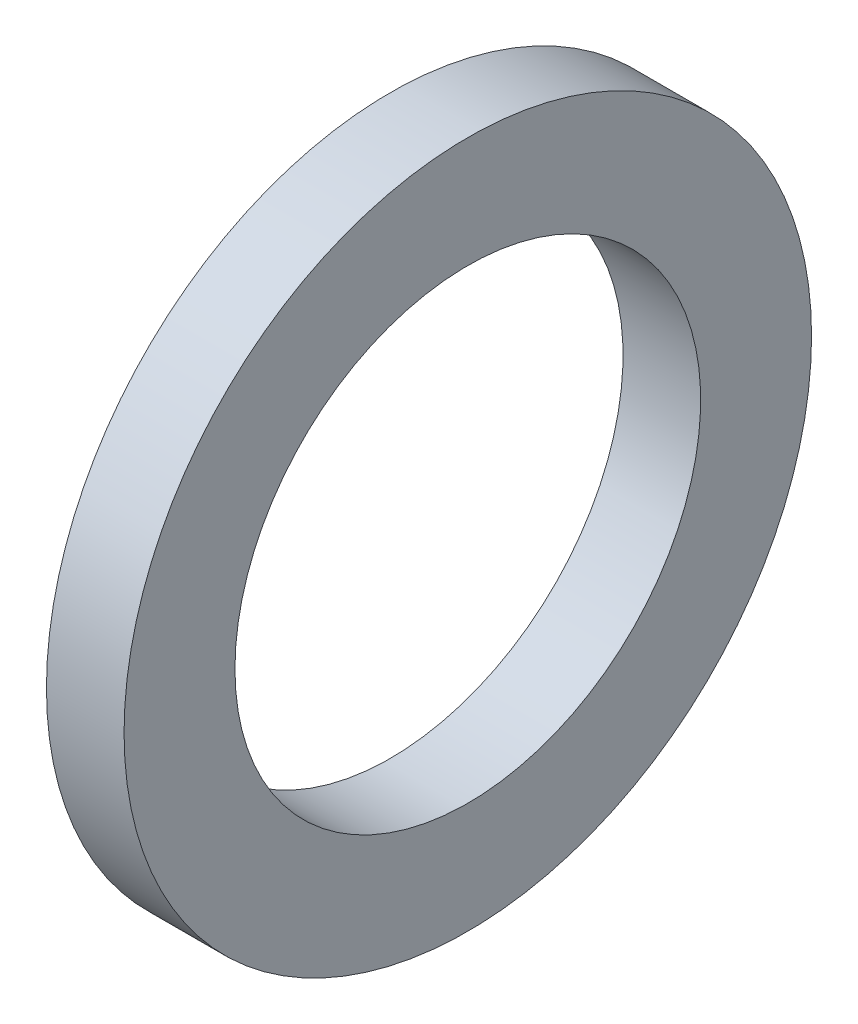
from build123d import *

# Parameters (mm, degrees)
SKETCH1_W = 3.5
SKETCH1_H = 5


with BuildPart() as part:
    # Sketch1 → Base-Revolve (revolve)
    with BuildSketch(Plane.XY, mode=Mode.PRIVATE) as base_revolve_sk:
        with Locations((-1.75, 13)):
            Rectangle(SKETCH1_W, SKETCH1_H)
    revolve(base_revolve_sk.sketch.rotate(Axis((-34.925, 0, 0), (1, 0, 0)), 90), axis=Axis((-34.925, 0, 0), (1, 0, 0)))


solid = part.part
